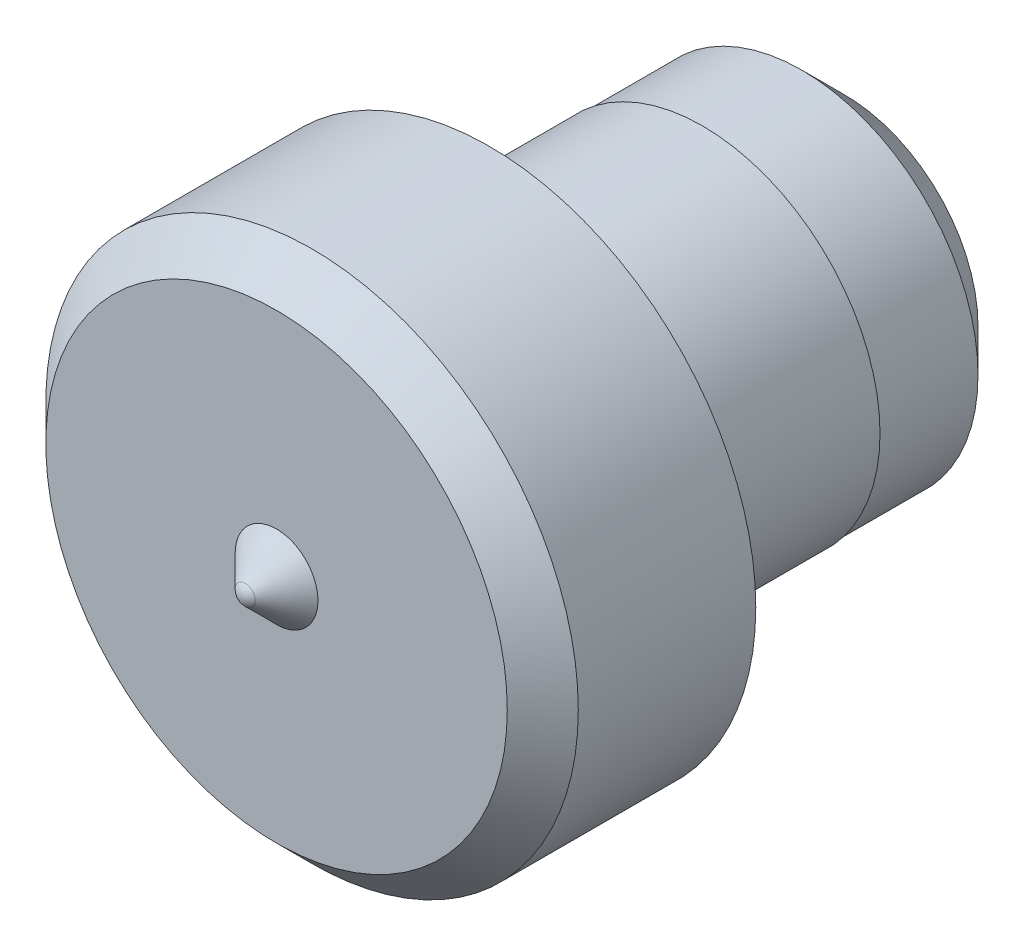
ISO-10303-21;
HEADER;
FILE_DESCRIPTION(('STEP AP214'),'2;1');
FILE_NAME('part.step','',(''),(''),'','','');
FILE_SCHEMA(('AUTOMOTIVE_DESIGN { 1 0 10303 214 1 1 1 1 }'));
ENDSEC;
DATA;
#1=APPLICATION_CONTEXT('core data for automotive mechanical design processes');
#2=APPLICATION_PROTOCOL_DEFINITION('international standard','automotive_design',2000,#1);
#3=PRODUCT_CONTEXT('',#1,'mechanical');
#4=PRODUCT('Part','Part','',(#3));
#5=PRODUCT_RELATED_PRODUCT_CATEGORY('part','',(#4));
#6=PRODUCT_DEFINITION_FORMATION('','',#4);
#7=PRODUCT_DEFINITION_CONTEXT('part definition',#1,'design');
#8=PRODUCT_DEFINITION('design','',#6,#7);
#9=PRODUCT_DEFINITION_SHAPE('','',#8);
#10=(LENGTH_UNIT() NAMED_UNIT(*) SI_UNIT(.MILLI.,.METRE.));
#11=(NAMED_UNIT(*) PLANE_ANGLE_UNIT() SI_UNIT($,.RADIAN.));
#12=(NAMED_UNIT(*) SI_UNIT($,.STERADIAN.) SOLID_ANGLE_UNIT());
#13=UNCERTAINTY_MEASURE_WITH_UNIT(LENGTH_MEASURE(1.E-05),#10,'distance_accuracy_value','');
#14=(GEOMETRIC_REPRESENTATION_CONTEXT(3) GLOBAL_UNCERTAINTY_ASSIGNED_CONTEXT((#13)) GLOBAL_UNIT_ASSIGNED_CONTEXT((#10,
#11,#12)) REPRESENTATION_CONTEXT('',''));
#15=CARTESIAN_POINT('',(0.,0.,0.));
#16=DIRECTION('',(0.,0.,1.));
#17=DIRECTION('',(1.,0.,0.));
#18=AXIS2_PLACEMENT_3D('',#15,#16,#17);
#19=CARTESIAN_POINT('',(0.,0.,3.3));
#20=DIRECTION('',(0.,0.,1.));
#21=DIRECTION('',(0.,1.,0.));
#22=AXIS2_PLACEMENT_3D('',#19,#20,#21);
#23=SPHERICAL_SURFACE('',#22,0.200000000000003);
#24=CARTESIAN_POINT('',(0.,0.,3.44142135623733));
#25=DIRECTION('',(0.,0.,1.));
#26=DIRECTION('',(1.,0.,0.));
#27=AXIS2_PLACEMENT_3D('',#24,#25,#26);
#28=CIRCLE('',#27,0.141421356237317);
#29=CARTESIAN_POINT('',(-0.141421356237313,0.,3.44142135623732));
#30=VERTEX_POINT('',#29);
#31=EDGE_CURVE('E46',#30,#30,#28,.T.);
#32=ORIENTED_EDGE('',*,*,#31,.T.);
#33=EDGE_LOOP('',(#32));
#34=FACE_BOUND('',#33,.T.);
#35=ADVANCED_FACE('F12',(#34),#23,.T.);
#36=CARTESIAN_POINT('',(0.,1.88,-5.));
#37=DIRECTION('',(0.,0.,1.));
#38=DIRECTION('',(1.,0.,0.));
#39=AXIS2_PLACEMENT_3D('',#36,#37,#38);
#40=PLANE('',#39);
#41=CARTESIAN_POINT('',(0.,0.,-5.));
#42=DIRECTION('',(0.,0.,1.));
#43=DIRECTION('',(1.,0.,0.));
#44=AXIS2_PLACEMENT_3D('',#41,#42,#43);
#45=CIRCLE('',#44,1.88);
#46=CARTESIAN_POINT('',(1.88,0.,-5.));
#47=VERTEX_POINT('',#46);
#48=EDGE_CURVE('E8',#47,#47,#45,.T.);
#49=ORIENTED_EDGE('',*,*,#48,.F.);
#50=EDGE_LOOP('',(#49));
#51=FACE_BOUND('',#50,.T.);
#52=ADVANCED_FACE('F102',(#51),#40,.F.);
#53=CARTESIAN_POINT('',(0.,0.,-5.));
#54=DIRECTION('',(0.,0.,1.));
#55=DIRECTION('',(1.,0.,0.));
#56=AXIS2_PLACEMENT_3D('',#53,#54,#55);
#57=CONICAL_SURFACE('',#56,1.88,0.785398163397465);
#58=CARTESIAN_POINT('',(0.,0.,-4.4));
#59=DIRECTION('',(0.,0.,1.));
#60=DIRECTION('',(1.,0.,0.));
#61=AXIS2_PLACEMENT_3D('',#58,#59,#60);
#62=CIRCLE('',#61,2.48);
#63=CARTESIAN_POINT('',(2.48,0.,-4.4));
#64=VERTEX_POINT('',#63);
#65=EDGE_CURVE('E18',#64,#64,#62,.T.);
#66=ORIENTED_EDGE('',*,*,#65,.F.);
#67=EDGE_LOOP('',(#66));
#68=FACE_BOUND('',#67,.T.);
#69=ORIENTED_EDGE('',*,*,#48,.T.);
#70=EDGE_LOOP('',(#69));
#71=FACE_BOUND('',#70,.T.);
#72=ADVANCED_FACE('F95',(#68,#71),#57,.T.);
#73=CARTESIAN_POINT('',(0.,0.,6.));
#74=DIRECTION('',(0.,0.,1.));
#75=DIRECTION('',(1.,0.,0.));
#76=AXIS2_PLACEMENT_3D('',#73,#74,#75);
#77=CYLINDRICAL_SURFACE('',#76,2.48);
#78=CARTESIAN_POINT('',(0.,0.,-3.));
#79=DIRECTION('',(0.,0.,1.));
#80=DIRECTION('',(1.,0.,0.));
#81=AXIS2_PLACEMENT_3D('',#78,#79,#80);
#82=CIRCLE('',#81,2.48);
#83=CARTESIAN_POINT('',(2.48,0.,-3.));
#84=VERTEX_POINT('',#83);
#85=EDGE_CURVE('E22',#84,#84,#82,.T.);
#86=ORIENTED_EDGE('',*,*,#85,.F.);
#87=EDGE_LOOP('',(#86));
#88=FACE_BOUND('',#87,.T.);
#89=ORIENTED_EDGE('',*,*,#65,.T.);
#90=EDGE_LOOP('',(#89));
#91=FACE_BOUND('',#90,.T.);
#92=ADVANCED_FACE('F90',(#88,#91),#77,.T.);
#93=CARTESIAN_POINT('',(0.,2.48,-3.));
#94=DIRECTION('',(0.,0.,1.));
#95=DIRECTION('',(1.,0.,0.));
#96=AXIS2_PLACEMENT_3D('',#93,#94,#95);
#97=PLANE('',#96);
#98=CARTESIAN_POINT('',(0.,0.,-3.));
#99=DIRECTION('',(0.,0.,1.));
#100=DIRECTION('',(1.,0.,0.));
#101=AXIS2_PLACEMENT_3D('',#98,#99,#100);
#102=CIRCLE('',#101,2.5);
#103=CARTESIAN_POINT('',(2.5,0.,-3.));
#104=VERTEX_POINT('',#103);
#105=EDGE_CURVE('E26',#104,#104,#102,.T.);
#106=ORIENTED_EDGE('',*,*,#105,.F.);
#107=EDGE_LOOP('',(#106));
#108=FACE_BOUND('',#107,.T.);
#109=ORIENTED_EDGE('',*,*,#85,.T.);
#110=EDGE_LOOP('',(#109));
#111=FACE_BOUND('',#110,.T.);
#112=ADVANCED_FACE('F84',(#108,#111),#97,.F.);
#113=CARTESIAN_POINT('',(0.,0.,6.));
#114=DIRECTION('',(0.,0.,1.));
#115=DIRECTION('',(1.,0.,0.));
#116=AXIS2_PLACEMENT_3D('',#113,#114,#115);
#117=CYLINDRICAL_SURFACE('',#116,2.5);
#118=CARTESIAN_POINT('',(0.,0.,0.));
#119=DIRECTION('',(0.,0.,1.));
#120=DIRECTION('',(1.,0.,0.));
#121=AXIS2_PLACEMENT_3D('',#118,#119,#120);
#122=CIRCLE('',#121,2.5);
#123=CARTESIAN_POINT('',(2.5,0.,0.));
#124=VERTEX_POINT('',#123);
#125=EDGE_CURVE('E31',#124,#124,#122,.T.);
#126=ORIENTED_EDGE('',*,*,#125,.F.);
#127=EDGE_LOOP('',(#126));
#128=FACE_BOUND('',#127,.T.);
#129=ORIENTED_EDGE('',*,*,#105,.T.);
#130=EDGE_LOOP('',(#129));
#131=FACE_BOUND('',#130,.T.);
#132=ADVANCED_FACE('F78',(#128,#131),#117,.T.);
#133=CARTESIAN_POINT('',(0.,2.5,0.));
#134=DIRECTION('',(0.,0.,1.));
#135=DIRECTION('',(1.,0.,0.));
#136=AXIS2_PLACEMENT_3D('',#133,#134,#135);
#137=PLANE('',#136);
#138=CARTESIAN_POINT('',(0.,0.,0.));
#139=DIRECTION('',(0.,0.,1.));
#140=DIRECTION('',(1.,0.,0.));
#141=AXIS2_PLACEMENT_3D('',#138,#139,#140);
#142=CIRCLE('',#141,3.75);
#143=CARTESIAN_POINT('',(3.75,0.,0.));
#144=VERTEX_POINT('',#143);
#145=EDGE_CURVE('E34',#144,#144,#142,.T.);
#146=ORIENTED_EDGE('',*,*,#145,.F.);
#147=EDGE_LOOP('',(#146));
#148=FACE_BOUND('',#147,.T.);
#149=ORIENTED_EDGE('',*,*,#125,.T.);
#150=EDGE_LOOP('',(#149));
#151=FACE_BOUND('',#150,.T.);
#152=ADVANCED_FACE('F72',(#148,#151),#137,.F.);
#153=CARTESIAN_POINT('',(0.,0.,6.));
#154=DIRECTION('',(0.,0.,1.));
#155=DIRECTION('',(1.,0.,0.));
#156=AXIS2_PLACEMENT_3D('',#153,#154,#155);
#157=CYLINDRICAL_SURFACE('',#156,3.75);
#158=CARTESIAN_POINT('',(0.,0.,2.5));
#159=DIRECTION('',(0.,0.,1.));
#160=DIRECTION('',(1.,0.,0.));
#161=AXIS2_PLACEMENT_3D('',#158,#159,#160);
#162=CIRCLE('',#161,3.75);
#163=CARTESIAN_POINT('',(3.75,0.,2.5));
#164=VERTEX_POINT('',#163);
#165=EDGE_CURVE('E37',#164,#164,#162,.T.);
#166=ORIENTED_EDGE('',*,*,#165,.F.);
#167=EDGE_LOOP('',(#166));
#168=FACE_BOUND('',#167,.T.);
#169=ORIENTED_EDGE('',*,*,#145,.T.);
#170=EDGE_LOOP('',(#169));
#171=FACE_BOUND('',#170,.T.);
#172=ADVANCED_FACE('F66',(#168,#171),#157,.T.);
#173=CARTESIAN_POINT('',(0.,0.,2.5));
#174=DIRECTION('',(0.,0.,-1.));
#175=DIRECTION('',(-1.,0.,0.));
#176=AXIS2_PLACEMENT_3D('',#173,#174,#175);
#177=CONICAL_SURFACE('',#176,3.75,0.785398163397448);
#178=CARTESIAN_POINT('',(0.,0.,3.));
#179=DIRECTION('',(0.,0.,1.));
#180=DIRECTION('',(1.,0.,0.));
#181=AXIS2_PLACEMENT_3D('',#178,#179,#180);
#182=CIRCLE('',#181,3.25);
#183=CARTESIAN_POINT('',(3.25,0.,3.));
#184=VERTEX_POINT('',#183);
#185=EDGE_CURVE('E40',#184,#184,#182,.T.);
#186=ORIENTED_EDGE('',*,*,#185,.F.);
#187=EDGE_LOOP('',(#186));
#188=FACE_BOUND('',#187,.T.);
#189=ORIENTED_EDGE('',*,*,#165,.T.);
#190=EDGE_LOOP('',(#189));
#191=FACE_BOUND('',#190,.T.);
#192=ADVANCED_FACE('F60',(#188,#191),#177,.T.);
#193=CARTESIAN_POINT('',(0.,0.582842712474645,3.));
#194=DIRECTION('',(0.,0.,-1.));
#195=DIRECTION('',(-1.,0.,0.));
#196=AXIS2_PLACEMENT_3D('',#193,#194,#195);
#197=PLANE('',#196);
#198=CARTESIAN_POINT('',(0.,0.,3.));
#199=DIRECTION('',(0.,0.,1.));
#200=DIRECTION('',(1.,0.,0.));
#201=AXIS2_PLACEMENT_3D('',#198,#199,#200);
#202=CIRCLE('',#201,0.582842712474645);
#203=CARTESIAN_POINT('',(-0.582842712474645,0.,3.));
#204=VERTEX_POINT('',#203);
#205=EDGE_CURVE('E43',#204,#204,#202,.T.);
#206=ORIENTED_EDGE('',*,*,#205,.F.);
#207=EDGE_LOOP('',(#206));
#208=FACE_BOUND('',#207,.T.);
#209=ORIENTED_EDGE('',*,*,#185,.T.);
#210=EDGE_LOOP('',(#209));
#211=FACE_BOUND('',#210,.T.);
#212=ADVANCED_FACE('F54',(#208,#211),#197,.F.);
#213=CARTESIAN_POINT('',(0.,0.,3.));
#214=DIRECTION('',(0.,0.,-1.));
#215=DIRECTION('',(-1.,0.,0.));
#216=AXIS2_PLACEMENT_3D('',#213,#214,#215);
#217=CONICAL_SURFACE('',#216,0.582842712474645,0.785398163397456);
#218=CARTESIAN_POINT('',(-0.141421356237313,0.,3.44142135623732));
#219=CARTESIAN_POINT('',(-0.146019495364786,0.,3.43682321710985));
#220=CARTESIAN_POINT('',(-0.150617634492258,0.,3.43222507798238));
#221=CARTESIAN_POINT('',(-0.159813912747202,0.,3.42302879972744));
#222=CARTESIAN_POINT('',(-0.164412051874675,0.,3.41843066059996));
#223=CARTESIAN_POINT('',(-0.173608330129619,0.,3.40923438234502));
#224=CARTESIAN_POINT('',(-0.178206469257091,0.,3.40463624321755));
#225=CARTESIAN_POINT('',(-0.187402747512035,0.,3.3954399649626));
#226=CARTESIAN_POINT('',(-0.192000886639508,0.,3.39084182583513));
#227=CARTESIAN_POINT('',(-0.201197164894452,0.,3.38164554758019));
#228=CARTESIAN_POINT('',(-0.205795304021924,0.,3.37704740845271));
#229=CARTESIAN_POINT('',(-0.214991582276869,0.,3.36785113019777));
#230=CARTESIAN_POINT('',(-0.219589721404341,0.,3.3632529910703));
#231=CARTESIAN_POINT('',(-0.228785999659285,0.,3.35405671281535));
#232=CARTESIAN_POINT('',(-0.233384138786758,0.,3.34945857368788));
#233=CARTESIAN_POINT('',(-0.242580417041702,0.,3.34026229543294));
#234=CARTESIAN_POINT('',(-0.247178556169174,0.,3.33566415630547));
#235=CARTESIAN_POINT('',(-0.256374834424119,0.,3.32646787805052));
#236=CARTESIAN_POINT('',(-0.260972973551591,0.,3.32186973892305));
#237=CARTESIAN_POINT('',(-0.270169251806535,0.,3.3126734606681));
#238=CARTESIAN_POINT('',(-0.274767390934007,0.,3.30807532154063));
#239=CARTESIAN_POINT('',(-0.283963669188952,0.,3.29887904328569));
#240=CARTESIAN_POINT('',(-0.288561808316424,0.,3.29428090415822));
#241=CARTESIAN_POINT('',(-0.297758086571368,0.,3.28508462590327));
#242=CARTESIAN_POINT('',(-0.302356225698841,0.,3.2804864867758));
#243=CARTESIAN_POINT('',(-0.311552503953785,0.,3.27129020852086));
#244=CARTESIAN_POINT('',(-0.316150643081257,0.,3.26669206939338));
#245=CARTESIAN_POINT('',(-0.325346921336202,0.,3.25749579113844));
#246=CARTESIAN_POINT('',(-0.329945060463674,0.,3.25289765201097));
#247=CARTESIAN_POINT('',(-0.339141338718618,0.,3.24370137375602));
#248=CARTESIAN_POINT('',(-0.34373947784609,0.,3.23910323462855));
#249=CARTESIAN_POINT('',(-0.352935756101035,0.,3.22990695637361));
#250=CARTESIAN_POINT('',(-0.357533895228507,0.,3.22530881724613));
#251=CARTESIAN_POINT('',(-0.366730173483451,0.,3.21611253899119));
#252=CARTESIAN_POINT('',(-0.371328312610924,0.,3.21151439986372));
#253=CARTESIAN_POINT('',(-0.380524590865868,0.,3.20231812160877));
#254=CARTESIAN_POINT('',(-0.38512272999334,0.,3.1977199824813));
#255=CARTESIAN_POINT('',(-0.394319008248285,0.,3.18852370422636));
#256=CARTESIAN_POINT('',(-0.398917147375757,0.,3.18392556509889));
#257=CARTESIAN_POINT('',(-0.408113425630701,0.,3.17472928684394));
#258=CARTESIAN_POINT('',(-0.412711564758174,0.,3.17013114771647));
#259=CARTESIAN_POINT('',(-0.421907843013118,0.,3.16093486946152));
#260=CARTESIAN_POINT('',(-0.42650598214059,0.,3.15633673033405));
#261=CARTESIAN_POINT('',(-0.435702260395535,0.,3.14714045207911));
#262=CARTESIAN_POINT('',(-0.440300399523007,0.,3.14254231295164));
#263=CARTESIAN_POINT('',(-0.449496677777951,0.,3.13334603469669));
#264=CARTESIAN_POINT('',(-0.454094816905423,0.,3.12874789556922));
#265=CARTESIAN_POINT('',(-0.463291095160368,0.,3.11955161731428));
#266=CARTESIAN_POINT('',(-0.46788923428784,0.,3.1149534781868));
#267=CARTESIAN_POINT('',(-0.477085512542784,0.,3.10575719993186));
#268=CARTESIAN_POINT('',(-0.481683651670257,0.,3.10115906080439));
#269=CARTESIAN_POINT('',(-0.490879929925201,0.,3.09196278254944));
#270=CARTESIAN_POINT('',(-0.495478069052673,0.,3.08736464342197));
#271=CARTESIAN_POINT('',(-0.504674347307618,0.,3.07816836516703));
#272=CARTESIAN_POINT('',(-0.50927248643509,0.,3.07357022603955));
#273=CARTESIAN_POINT('',(-0.518468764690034,0.,3.06437394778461));
#274=CARTESIAN_POINT('',(-0.523066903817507,0.,3.05977580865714));
#275=CARTESIAN_POINT('',(-0.532263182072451,0.,3.05057953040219));
#276=CARTESIAN_POINT('',(-0.536861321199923,0.,3.04598139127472));
#277=CARTESIAN_POINT('',(-0.546057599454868,0.,3.03678511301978));
#278=CARTESIAN_POINT('',(-0.55065573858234,0.,3.0321869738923));
#279=CARTESIAN_POINT('',(-0.559852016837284,0.,3.02299069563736));
#280=CARTESIAN_POINT('',(-0.564450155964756,0.,3.01839255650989));
#281=CARTESIAN_POINT('',(-0.573646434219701,0.,3.00919627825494));
#282=CARTESIAN_POINT('',(-0.578244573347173,0.,3.00459813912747));
#283=CARTESIAN_POINT('',(-0.582842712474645,0.,3.));
#284=B_SPLINE_CURVE_WITH_KNOTS('',3,(#218,#219,#220,#221,#222,#223,#224,#225,#226,#227,#228,
#229,#230,#231,#232,#233,#234,#235,#236,#237,#238,#239,#240,#241,#242,#243,#244,#245,#246,#247,
#248,#249,#250,#251,#252,#253,#254,#255,#256,#257,#258,#259,#260,#261,#262,#263,#264,#265,#266,
#267,#268,#269,#270,#271,#272,#273,#274,#275,#276,#277,#278,#279,#280,#281,#282,#283),
.UNSPECIFIED.,.F.,.F.,(4,2,2,2,2,2,2,2,2,2,2,2,2,2,2,2,2,2,2,2,2,2,2,2,2,2,2,2,2,2,2,2,4),(0.,
0.0195082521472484,0.0390165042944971,0.0585247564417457,0.0780330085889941,0.0975412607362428,
0.117049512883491,0.13655776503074,0.156066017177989,0.175574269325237,0.195082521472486,
0.214590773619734,0.234099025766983,0.253607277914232,0.27311553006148,0.292623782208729,
0.312132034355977,0.331640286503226,0.351148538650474,0.370656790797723,0.390165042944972,
0.40967329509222,0.429181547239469,0.448689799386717,0.468198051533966,0.487706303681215,
0.507214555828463,0.526722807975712,0.546231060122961,0.565739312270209,0.585247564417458,
0.604755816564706,0.624264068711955),.UNSPECIFIED.);
#285=EDGE_CURVE('BSEAM51',#30,#204,#284,.T.);
#286=ORIENTED_EDGE('',*,*,#31,.F.);
#287=ORIENTED_EDGE('',*,*,#205,.T.);
#288=ORIENTED_EDGE('',*,*,#285,.T.);
#289=ORIENTED_EDGE('',*,*,#285,.F.);
#290=EDGE_LOOP('',(#286,#288,#287,#289));
#291=FACE_BOUND('',#290,.T.);
#292=ADVANCED_FACE('F51',(#291),#217,.T.);
#293=CLOSED_SHELL('',(#35,#52,#72,#92,#112,#132,#152,#172,#192,#212,#292));
#294=MANIFOLD_SOLID_BREP('B1',#293);
#295=ADVANCED_BREP_SHAPE_REPRESENTATION('',(#18,#294),#14);
#296=SHAPE_DEFINITION_REPRESENTATION(#9,#295);
ENDSEC;
END-ISO-10303-21;
